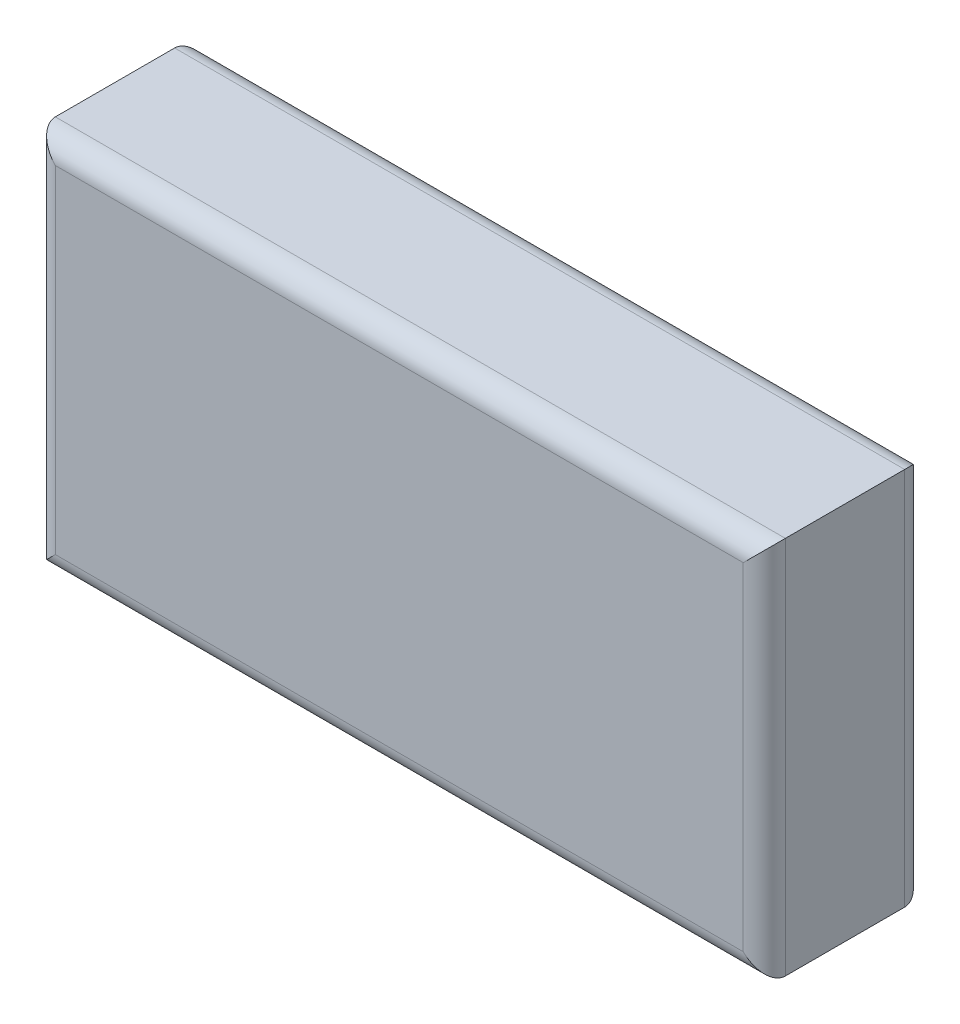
ISO-10303-21;
HEADER;
FILE_DESCRIPTION(('STEP AP214'),'2;1');
FILE_NAME('part.step','',(''),(''),'','','');
FILE_SCHEMA(('AUTOMOTIVE_DESIGN { 1 0 10303 214 1 1 1 1 }'));
ENDSEC;
DATA;
#1=APPLICATION_CONTEXT('core data for automotive mechanical design processes');
#2=APPLICATION_PROTOCOL_DEFINITION('international standard','automotive_design',2000,#1);
#3=PRODUCT_CONTEXT('',#1,'mechanical');
#4=PRODUCT('Part','Part','',(#3));
#5=PRODUCT_RELATED_PRODUCT_CATEGORY('part','',(#4));
#6=PRODUCT_DEFINITION_FORMATION('','',#4);
#7=PRODUCT_DEFINITION_CONTEXT('part definition',#1,'design');
#8=PRODUCT_DEFINITION('design','',#6,#7);
#9=PRODUCT_DEFINITION_SHAPE('','',#8);
#10=(LENGTH_UNIT() NAMED_UNIT(*) SI_UNIT(.MILLI.,.METRE.));
#11=(NAMED_UNIT(*) PLANE_ANGLE_UNIT() SI_UNIT($,.RADIAN.));
#12=(NAMED_UNIT(*) SI_UNIT($,.STERADIAN.) SOLID_ANGLE_UNIT());
#13=UNCERTAINTY_MEASURE_WITH_UNIT(LENGTH_MEASURE(1.E-05),#10,'distance_accuracy_value','');
#14=(GEOMETRIC_REPRESENTATION_CONTEXT(3) GLOBAL_UNCERTAINTY_ASSIGNED_CONTEXT((#13)) GLOBAL_UNIT_ASSIGNED_CONTEXT((#10,
#11,#12)) REPRESENTATION_CONTEXT('',''));
#15=CARTESIAN_POINT('',(0.,0.,0.));
#16=DIRECTION('',(0.,0.,1.));
#17=DIRECTION('',(1.,0.,0.));
#18=AXIS2_PLACEMENT_3D('',#15,#16,#17);
#19=CARTESIAN_POINT('',(0.,0.,11.5));
#20=DIRECTION('',(1.,0.,0.));
#21=DIRECTION('',(0.,0.,-1.));
#22=AXIS2_PLACEMENT_3D('',#19,#20,#21);
#23=PLANE('',#22);
#24=DIRECTION('',(0.,0.,-1.));
#25=VECTOR('',#24,1.);
#26=CARTESIAN_POINT('',(0.,27.,11.5));
#27=LINE('',#26,#25);
#28=CARTESIAN_POINT('',(0.,27.,10.));
#29=VERTEX_POINT('',#28);
#30=CARTESIAN_POINT('',(0.,27.,1.5));
#31=VERTEX_POINT('',#30);
#32=EDGE_CURVE('E127',#29,#31,#27,.T.);
#33=ORIENTED_EDGE('',*,*,#32,.T.);
#34=DIRECTION('',(0.,-1.,0.));
#35=VECTOR('',#34,1.);
#36=CARTESIAN_POINT('',(0.,0.,1.5));
#37=LINE('',#36,#35);
#38=CARTESIAN_POINT('',(0.,0.,1.5));
#39=VERTEX_POINT('',#38);
#40=EDGE_CURVE('E136',#31,#39,#37,.T.);
#41=ORIENTED_EDGE('',*,*,#40,.T.);
#42=DIRECTION('',(0.,0.,-1.));
#43=VECTOR('',#42,1.);
#44=CARTESIAN_POINT('',(0.,0.,11.5));
#45=LINE('',#44,#43);
#46=CARTESIAN_POINT('',(0.,0.,10.));
#47=VERTEX_POINT('',#46);
#48=EDGE_CURVE('E105',#47,#39,#45,.T.);
#49=ORIENTED_EDGE('',*,*,#48,.F.);
#50=DIRECTION('',(0.,-1.,0.));
#51=VECTOR('',#50,1.);
#52=CARTESIAN_POINT('',(0.,0.,10.));
#53=LINE('',#52,#51);
#54=EDGE_CURVE('E138',#47,#29,#53,.F.);
#55=ORIENTED_EDGE('',*,*,#54,.T.);
#56=EDGE_LOOP('',(#33,#41,#49,#55));
#57=FACE_BOUND('',#56,.T.);
#58=ADVANCED_FACE('F18',(#57),#23,.F.);
#59=CARTESIAN_POINT('',(0.,0.,11.5));
#60=DIRECTION('',(0.,1.,0.));
#61=DIRECTION('',(0.,0.,1.));
#62=AXIS2_PLACEMENT_3D('',#59,#60,#61);
#63=PLANE('',#62);
#64=ORIENTED_EDGE('',*,*,#48,.T.);
#65=DIRECTION('',(1.,0.,0.));
#66=VECTOR('',#65,1.);
#67=CARTESIAN_POINT('',(52.,0.,1.5));
#68=LINE('',#67,#66);
#69=CARTESIAN_POINT('',(52.,0.,1.5));
#70=VERTEX_POINT('',#69);
#71=EDGE_CURVE('E104',#39,#70,#68,.T.);
#72=ORIENTED_EDGE('',*,*,#71,.T.);
#73=DIRECTION('',(0.,0.,-1.));
#74=VECTOR('',#73,1.);
#75=CARTESIAN_POINT('',(52.,0.,11.5));
#76=LINE('',#75,#74);
#77=CARTESIAN_POINT('',(52.,0.,10.));
#78=VERTEX_POINT('',#77);
#79=EDGE_CURVE('E87',#78,#70,#76,.T.);
#80=ORIENTED_EDGE('',*,*,#79,.F.);
#81=DIRECTION('',(1.,0.,0.));
#82=VECTOR('',#81,1.);
#83=CARTESIAN_POINT('',(0.,0.,10.));
#84=LINE('',#83,#82);
#85=EDGE_CURVE('E101',#78,#47,#84,.F.);
#86=ORIENTED_EDGE('',*,*,#85,.T.);
#87=EDGE_LOOP('',(#64,#72,#80,#86));
#88=FACE_BOUND('',#87,.T.);
#89=ADVANCED_FACE('F100',(#88),#63,.F.);
#90=CARTESIAN_POINT('',(52.,0.,11.5));
#91=DIRECTION('',(-1.,0.,0.));
#92=DIRECTION('',(0.,0.,1.));
#93=AXIS2_PLACEMENT_3D('',#90,#91,#92);
#94=PLANE('',#93);
#95=ORIENTED_EDGE('',*,*,#79,.T.);
#96=DIRECTION('',(0.,1.,0.));
#97=VECTOR('',#96,1.);
#98=CARTESIAN_POINT('',(52.,27.,1.5));
#99=LINE('',#98,#97);
#100=CARTESIAN_POINT('',(52.,27.,1.5));
#101=VERTEX_POINT('',#100);
#102=EDGE_CURVE('E93',#70,#101,#99,.T.);
#103=ORIENTED_EDGE('',*,*,#102,.T.);
#104=DIRECTION('',(0.,0.,-1.));
#105=VECTOR('',#104,1.);
#106=CARTESIAN_POINT('',(52.,27.,11.5));
#107=LINE('',#106,#105);
#108=CARTESIAN_POINT('',(52.,27.,10.));
#109=VERTEX_POINT('',#108);
#110=EDGE_CURVE('E89',#109,#101,#107,.T.);
#111=ORIENTED_EDGE('',*,*,#110,.F.);
#112=DIRECTION('',(0.,1.,0.));
#113=VECTOR('',#112,1.);
#114=CARTESIAN_POINT('',(52.,0.,10.));
#115=LINE('',#114,#113);
#116=EDGE_CURVE('E84',#109,#78,#115,.F.);
#117=ORIENTED_EDGE('',*,*,#116,.T.);
#118=EDGE_LOOP('',(#95,#103,#111,#117));
#119=FACE_BOUND('',#118,.T.);
#120=ADVANCED_FACE('F86',(#119),#94,.F.);
#121=CARTESIAN_POINT('',(0.,27.,11.5));
#122=DIRECTION('',(0.,-1.,0.));
#123=DIRECTION('',(0.,0.,-1.));
#124=AXIS2_PLACEMENT_3D('',#121,#122,#123);
#125=PLANE('',#124);
#126=ORIENTED_EDGE('',*,*,#110,.T.);
#127=DIRECTION('',(-1.,0.,0.));
#128=VECTOR('',#127,1.);
#129=CARTESIAN_POINT('',(0.,27.,1.5));
#130=LINE('',#129,#128);
#131=EDGE_CURVE('E140',#101,#31,#130,.T.);
#132=ORIENTED_EDGE('',*,*,#131,.T.);
#133=ORIENTED_EDGE('',*,*,#32,.F.);
#134=DIRECTION('',(-1.,0.,0.));
#135=VECTOR('',#134,1.);
#136=CARTESIAN_POINT('',(0.,27.,10.));
#137=LINE('',#136,#135);
#138=EDGE_CURVE('E142',#29,#109,#137,.F.);
#139=ORIENTED_EDGE('',*,*,#138,.T.);
#140=EDGE_LOOP('',(#126,#132,#133,#139));
#141=FACE_BOUND('',#140,.T.);
#142=ADVANCED_FACE('F180',(#141),#125,.F.);
#143=CARTESIAN_POINT('',(0.,0.,11.5));
#144=DIRECTION('',(0.,0.,-1.));
#145=DIRECTION('',(-1.,0.,0.));
#146=AXIS2_PLACEMENT_3D('',#143,#144,#145);
#147=PLANE('',#146);
#148=DIRECTION('',(0.,1.,0.));
#149=VECTOR('',#148,1.);
#150=CARTESIAN_POINT('',(50.5,0.,11.5));
#151=LINE('',#150,#149);
#152=CARTESIAN_POINT('',(50.5,1.5,11.5));
#153=VERTEX_POINT('',#152);
#154=CARTESIAN_POINT('',(50.5,25.5,11.5));
#155=VERTEX_POINT('',#154);
#156=EDGE_CURVE('E27',#153,#155,#151,.T.);
#157=ORIENTED_EDGE('',*,*,#156,.T.);
#158=DIRECTION('',(-1.,0.,0.));
#159=VECTOR('',#158,1.);
#160=CARTESIAN_POINT('',(0.,25.5,11.5));
#161=LINE('',#160,#159);
#162=CARTESIAN_POINT('',(1.5,25.5,11.5));
#163=VERTEX_POINT('',#162);
#164=EDGE_CURVE('E11',#155,#163,#161,.T.);
#165=ORIENTED_EDGE('',*,*,#164,.T.);
#166=DIRECTION('',(0.,-1.,0.));
#167=VECTOR('',#166,1.);
#168=CARTESIAN_POINT('',(1.5,0.,11.5));
#169=LINE('',#168,#167);
#170=CARTESIAN_POINT('',(1.5,1.5,11.5));
#171=VERTEX_POINT('',#170);
#172=EDGE_CURVE('E134',#163,#171,#169,.T.);
#173=ORIENTED_EDGE('',*,*,#172,.T.);
#174=DIRECTION('',(1.,0.,0.));
#175=VECTOR('',#174,1.);
#176=CARTESIAN_POINT('',(0.,1.5,11.5));
#177=LINE('',#176,#175);
#178=EDGE_CURVE('E38',#171,#153,#177,.T.);
#179=ORIENTED_EDGE('',*,*,#178,.T.);
#180=EDGE_LOOP('',(#157,#165,#173,#179));
#181=FACE_BOUND('',#180,.T.);
#182=ADVANCED_FACE('F186',(#181),#147,.F.);
#183=CARTESIAN_POINT('',(0.,0.,0.));
#184=DIRECTION('',(0.,0.,-1.));
#185=DIRECTION('',(-1.,0.,0.));
#186=AXIS2_PLACEMENT_3D('',#183,#184,#185);
#187=PLANE('',#186);
#188=DIRECTION('',(0.,1.,0.));
#189=VECTOR('',#188,1.);
#190=CARTESIAN_POINT('',(50.5,0.,0.));
#191=LINE('',#190,#189);
#192=CARTESIAN_POINT('',(50.5,25.5,0.));
#193=VERTEX_POINT('',#192);
#194=CARTESIAN_POINT('',(50.5,1.5,0.));
#195=VERTEX_POINT('',#194);
#196=EDGE_CURVE('E147',#193,#195,#191,.F.);
#197=ORIENTED_EDGE('',*,*,#196,.T.);
#198=DIRECTION('',(1.,0.,0.));
#199=VECTOR('',#198,1.);
#200=CARTESIAN_POINT('',(0.,1.5,0.));
#201=LINE('',#200,#199);
#202=CARTESIAN_POINT('',(1.5,1.5,0.));
#203=VERTEX_POINT('',#202);
#204=EDGE_CURVE('E94',#195,#203,#201,.F.);
#205=ORIENTED_EDGE('',*,*,#204,.T.);
#206=DIRECTION('',(0.,-1.,0.));
#207=VECTOR('',#206,1.);
#208=CARTESIAN_POINT('',(1.5,27.,0.));
#209=LINE('',#208,#207);
#210=CARTESIAN_POINT('',(1.5,25.5,0.));
#211=VERTEX_POINT('',#210);
#212=EDGE_CURVE('E151',#203,#211,#209,.F.);
#213=ORIENTED_EDGE('',*,*,#212,.T.);
#214=DIRECTION('',(-1.,0.,0.));
#215=VECTOR('',#214,1.);
#216=CARTESIAN_POINT('',(52.,25.5,0.));
#217=LINE('',#216,#215);
#218=EDGE_CURVE('E149',#211,#193,#217,.F.);
#219=ORIENTED_EDGE('',*,*,#218,.T.);
#220=EDGE_LOOP('',(#197,#205,#213,#219));
#221=FACE_BOUND('',#220,.T.);
#222=ADVANCED_FACE('F188',(#221),#187,.T.);
#223=CARTESIAN_POINT('',(0.,25.5,1.5));
#224=DIRECTION('',(1.,0.,0.));
#225=DIRECTION('',(0.,0.,-1.));
#226=AXIS2_PLACEMENT_3D('',#223,#224,#225);
#227=CYLINDRICAL_SURFACE('',#226,1.5);
#228=CARTESIAN_POINT('',(50.5,25.5,1.5));
#229=DIRECTION('',(0.707106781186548,-0.707106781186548,0.));
#230=DIRECTION('',(0.707106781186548,0.707106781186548,0.));
#231=AXIS2_PLACEMENT_3D('',#228,#229,#230);
#232=ELLIPSE('',#231,2.12132034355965,1.5);
#233=EDGE_CURVE('E128',#193,#101,#232,.T.);
#234=ORIENTED_EDGE('',*,*,#233,.F.);
#235=ORIENTED_EDGE('',*,*,#218,.F.);
#236=CARTESIAN_POINT('',(1.5,25.5,1.5));
#237=DIRECTION('',(0.707106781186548,0.707106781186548,0.));
#238=DIRECTION('',(-0.707106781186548,0.707106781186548,0.));
#239=AXIS2_PLACEMENT_3D('',#236,#237,#238);
#240=ELLIPSE('',#239,2.12132034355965,1.5);
#241=EDGE_CURVE('E124',#31,#211,#240,.F.);
#242=ORIENTED_EDGE('',*,*,#241,.F.);
#243=ORIENTED_EDGE('',*,*,#131,.F.);
#244=EDGE_LOOP('',(#234,#235,#242,#243));
#245=FACE_BOUND('',#244,.T.);
#246=ADVANCED_FACE('F167',(#245),#227,.T.);
#247=CARTESIAN_POINT('',(1.5,0.,1.5));
#248=DIRECTION('',(0.,1.,0.));
#249=DIRECTION('',(0.,0.,1.));
#250=AXIS2_PLACEMENT_3D('',#247,#248,#249);
#251=CYLINDRICAL_SURFACE('',#250,1.5);
#252=ORIENTED_EDGE('',*,*,#241,.T.);
#253=ORIENTED_EDGE('',*,*,#212,.F.);
#254=CARTESIAN_POINT('',(1.5,1.5,1.5));
#255=DIRECTION('',(-0.707106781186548,0.707106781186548,0.));
#256=DIRECTION('',(0.707106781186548,0.707106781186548,0.));
#257=AXIS2_PLACEMENT_3D('',#254,#255,#256);
#258=ELLIPSE('',#257,2.12132034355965,1.5);
#259=EDGE_CURVE('E115',#39,#203,#258,.F.);
#260=ORIENTED_EDGE('',*,*,#259,.F.);
#261=ORIENTED_EDGE('',*,*,#40,.F.);
#262=EDGE_LOOP('',(#252,#253,#260,#261));
#263=FACE_BOUND('',#262,.T.);
#264=ADVANCED_FACE('F171',(#263),#251,.T.);
#265=CARTESIAN_POINT('',(50.5,0.,1.5));
#266=DIRECTION('',(0.,-1.,0.));
#267=DIRECTION('',(0.,0.,-1.));
#268=AXIS2_PLACEMENT_3D('',#265,#266,#267);
#269=CYLINDRICAL_SURFACE('',#268,1.5);
#270=ORIENTED_EDGE('',*,*,#233,.T.);
#271=ORIENTED_EDGE('',*,*,#102,.F.);
#272=CARTESIAN_POINT('',(50.5,1.5,1.5));
#273=DIRECTION('',(-0.707106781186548,-0.707106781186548,0.));
#274=DIRECTION('',(0.707106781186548,-0.707106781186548,0.));
#275=AXIS2_PLACEMENT_3D('',#272,#273,#274);
#276=ELLIPSE('',#275,2.12132034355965,1.5);
#277=EDGE_CURVE('E114',#195,#70,#276,.T.);
#278=ORIENTED_EDGE('',*,*,#277,.F.);
#279=ORIENTED_EDGE('',*,*,#196,.F.);
#280=EDGE_LOOP('',(#270,#271,#278,#279));
#281=FACE_BOUND('',#280,.T.);
#282=ADVANCED_FACE('F179',(#281),#269,.T.);
#283=CARTESIAN_POINT('',(0.,1.5,1.5));
#284=DIRECTION('',(-1.,0.,0.));
#285=DIRECTION('',(0.,0.,1.));
#286=AXIS2_PLACEMENT_3D('',#283,#284,#285);
#287=CYLINDRICAL_SURFACE('',#286,1.5);
#288=ORIENTED_EDGE('',*,*,#259,.T.);
#289=ORIENTED_EDGE('',*,*,#204,.F.);
#290=ORIENTED_EDGE('',*,*,#277,.T.);
#291=ORIENTED_EDGE('',*,*,#71,.F.);
#292=EDGE_LOOP('',(#288,#289,#290,#291));
#293=FACE_BOUND('',#292,.T.);
#294=ADVANCED_FACE('F174',(#293),#287,.T.);
#295=CARTESIAN_POINT('',(0.,1.5,10.));
#296=DIRECTION('',(1.,0.,0.));
#297=DIRECTION('',(0.,0.,-1.));
#298=AXIS2_PLACEMENT_3D('',#295,#296,#297);
#299=CYLINDRICAL_SURFACE('',#298,1.5);
#300=CARTESIAN_POINT('',(1.5,1.5,10.));
#301=DIRECTION('',(0.707106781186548,-0.707106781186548,0.));
#302=DIRECTION('',(-0.707106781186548,-0.707106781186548,0.));
#303=AXIS2_PLACEMENT_3D('',#300,#301,#302);
#304=ELLIPSE('',#303,2.12132034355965,1.5);
#305=EDGE_CURVE('E110',#47,#171,#304,.F.);
#306=ORIENTED_EDGE('',*,*,#305,.F.);
#307=ORIENTED_EDGE('',*,*,#85,.F.);
#308=CARTESIAN_POINT('',(50.5,1.5,10.));
#309=DIRECTION('',(0.707106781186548,0.707106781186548,0.));
#310=DIRECTION('',(0.707106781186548,-0.707106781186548,0.));
#311=AXIS2_PLACEMENT_3D('',#308,#309,#310);
#312=ELLIPSE('',#311,2.12132034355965,1.5);
#313=EDGE_CURVE('E22',#153,#78,#312,.T.);
#314=ORIENTED_EDGE('',*,*,#313,.F.);
#315=ORIENTED_EDGE('',*,*,#178,.F.);
#316=EDGE_LOOP('',(#306,#307,#314,#315));
#317=FACE_BOUND('',#316,.T.);
#318=ADVANCED_FACE('F20',(#317),#299,.T.);
#319=CARTESIAN_POINT('',(50.5,0.,10.));
#320=DIRECTION('',(0.,1.,0.));
#321=DIRECTION('',(0.,0.,1.));
#322=AXIS2_PLACEMENT_3D('',#319,#320,#321);
#323=CYLINDRICAL_SURFACE('',#322,1.5);
#324=ORIENTED_EDGE('',*,*,#313,.T.);
#325=ORIENTED_EDGE('',*,*,#116,.F.);
#326=CARTESIAN_POINT('',(50.5,25.5,10.));
#327=DIRECTION('',(-0.707106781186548,0.707106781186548,0.));
#328=DIRECTION('',(0.707106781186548,0.707106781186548,0.));
#329=AXIS2_PLACEMENT_3D('',#326,#327,#328);
#330=ELLIPSE('',#329,2.12132034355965,1.5);
#331=EDGE_CURVE('E117',#155,#109,#330,.T.);
#332=ORIENTED_EDGE('',*,*,#331,.F.);
#333=ORIENTED_EDGE('',*,*,#156,.F.);
#334=EDGE_LOOP('',(#324,#325,#332,#333));
#335=FACE_BOUND('',#334,.T.);
#336=ADVANCED_FACE('F113',(#335),#323,.T.);
#337=CARTESIAN_POINT('',(1.5,0.,10.));
#338=DIRECTION('',(0.,-1.,0.));
#339=DIRECTION('',(0.,0.,-1.));
#340=AXIS2_PLACEMENT_3D('',#337,#338,#339);
#341=CYLINDRICAL_SURFACE('',#340,1.5);
#342=ORIENTED_EDGE('',*,*,#305,.T.);
#343=ORIENTED_EDGE('',*,*,#172,.F.);
#344=CARTESIAN_POINT('',(1.5,25.5,10.));
#345=DIRECTION('',(-0.707106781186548,-0.707106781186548,0.));
#346=DIRECTION('',(0.707106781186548,-0.707106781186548,0.));
#347=AXIS2_PLACEMENT_3D('',#344,#345,#346);
#348=ELLIPSE('',#347,2.12132034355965,1.5);
#349=EDGE_CURVE('E120',#29,#163,#348,.F.);
#350=ORIENTED_EDGE('',*,*,#349,.F.);
#351=ORIENTED_EDGE('',*,*,#54,.F.);
#352=EDGE_LOOP('',(#342,#343,#350,#351));
#353=FACE_BOUND('',#352,.T.);
#354=ADVANCED_FACE('F185',(#353),#341,.T.);
#355=CARTESIAN_POINT('',(0.,25.5,10.));
#356=DIRECTION('',(-1.,0.,0.));
#357=DIRECTION('',(0.,0.,1.));
#358=AXIS2_PLACEMENT_3D('',#355,#356,#357);
#359=CYLINDRICAL_SURFACE('',#358,1.5);
#360=ORIENTED_EDGE('',*,*,#331,.T.);
#361=ORIENTED_EDGE('',*,*,#138,.F.);
#362=ORIENTED_EDGE('',*,*,#349,.T.);
#363=ORIENTED_EDGE('',*,*,#164,.F.);
#364=EDGE_LOOP('',(#360,#361,#362,#363));
#365=FACE_BOUND('',#364,.T.);
#366=ADVANCED_FACE('F183',(#365),#359,.T.);
#367=CLOSED_SHELL('',(#58,#89,#120,#142,#182,#222,#246,#264,#282,#294,#318,#336,#354,#366));
#368=MANIFOLD_SOLID_BREP('B1',#367);
#369=ADVANCED_BREP_SHAPE_REPRESENTATION('',(#18,#368),#14);
#370=SHAPE_DEFINITION_REPRESENTATION(#9,#369);
ENDSEC;
END-ISO-10303-21;
